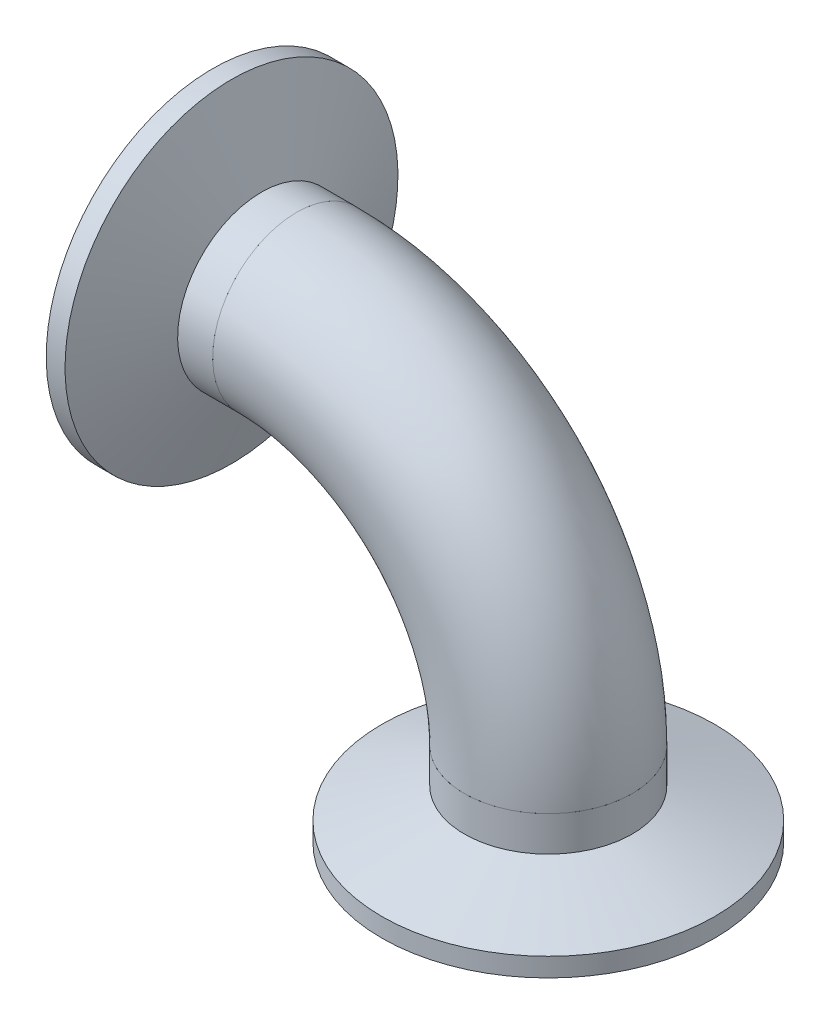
ISO-10303-21;
HEADER;
FILE_DESCRIPTION(('STEP AP214'),'2;1');
FILE_NAME('part.step','',(''),(''),'','','');
FILE_SCHEMA(('AUTOMOTIVE_DESIGN { 1 0 10303 214 1 1 1 1 }'));
ENDSEC;
DATA;
#1=APPLICATION_CONTEXT('core data for automotive mechanical design processes');
#2=APPLICATION_PROTOCOL_DEFINITION('international standard','automotive_design',2000,#1);
#3=PRODUCT_CONTEXT('',#1,'mechanical');
#4=PRODUCT('Part','Part','',(#3));
#5=PRODUCT_RELATED_PRODUCT_CATEGORY('part','',(#4));
#6=PRODUCT_DEFINITION_FORMATION('','',#4);
#7=PRODUCT_DEFINITION_CONTEXT('part definition',#1,'design');
#8=PRODUCT_DEFINITION('design','',#6,#7);
#9=PRODUCT_DEFINITION_SHAPE('','',#8);
#10=(LENGTH_UNIT() NAMED_UNIT(*) SI_UNIT(.MILLI.,.METRE.));
#11=(NAMED_UNIT(*) PLANE_ANGLE_UNIT() SI_UNIT($,.RADIAN.));
#12=(NAMED_UNIT(*) SI_UNIT($,.STERADIAN.) SOLID_ANGLE_UNIT());
#13=UNCERTAINTY_MEASURE_WITH_UNIT(LENGTH_MEASURE(1.E-05),#10,'distance_accuracy_value','');
#14=(GEOMETRIC_REPRESENTATION_CONTEXT(3) GLOBAL_UNCERTAINTY_ASSIGNED_CONTEXT((#13)) GLOBAL_UNIT_ASSIGNED_CONTEXT((#10,
#11,#12)) REPRESENTATION_CONTEXT('',''));
#15=CARTESIAN_POINT('',(0.,0.,0.));
#16=DIRECTION('',(0.,0.,1.));
#17=DIRECTION('',(1.,0.,0.));
#18=AXIS2_PLACEMENT_3D('',#15,#16,#17);
#19=CARTESIAN_POINT('',(6.05161411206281,16.6894268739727,52.4782290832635));
#20=DIRECTION('',(0.,0.,-1.));
#21=DIRECTION('',(-1.,0.,0.));
#22=AXIS2_PLACEMENT_3D('',#19,#20,#21);
#23=TOROIDAL_SURFACE('',#22,38.1,12.7);
#24=CARTESIAN_POINT('',(6.05161411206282,54.7894268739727,52.4782290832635));
#25=DIRECTION('',(-1.,0.,0.));
#26=DIRECTION('',(0.,0.,1.));
#27=AXIS2_PLACEMENT_3D('',#24,#25,#26);
#28=CIRCLE('',#27,12.7);
#29=CARTESIAN_POINT('',(6.05161411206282,67.4894268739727,52.4782290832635));
#30=VERTEX_POINT('',#29);
#31=EDGE_CURVE('P0_E10',#30,#30,#28,.T.);
#32=CARTESIAN_POINT('',(44.1516141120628,16.6894268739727,52.4782290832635));
#33=DIRECTION('',(0.,1.,0.));
#34=DIRECTION('',(0.,0.,1.));
#35=AXIS2_PLACEMENT_3D('',#32,#33,#34);
#36=CIRCLE('',#35,12.7);
#37=CARTESIAN_POINT('',(56.8516141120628,16.6894268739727,52.4782290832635));
#38=VERTEX_POINT('',#37);
#39=EDGE_CURVE('P0_E21',#38,#38,#36,.T.);
#40=CARTESIAN_POINT('',(6.05161411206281,16.6894268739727,52.4782290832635));
#41=DIRECTION('',(0.,0.,-1.));
#42=DIRECTION('',(-1.,0.,0.));
#43=AXIS2_PLACEMENT_3D('',#40,#41,#42);
#44=CIRCLE('',#43,50.8);
#45=EDGE_CURVE('',#30,#38,#44,.T.);
#46=ORIENTED_EDGE('',*,*,#31,.F.);
#47=ORIENTED_EDGE('',*,*,#39,.T.);
#48=ORIENTED_EDGE('',*,*,#45,.T.);
#49=ORIENTED_EDGE('',*,*,#45,.F.);
#50=EDGE_LOOP('',(#46,#48,#47,#49));
#51=FACE_BOUND('',#50,.T.);
#52=ADVANCED_FACE('P0_F15',(#51),#23,.T.);
#53=CARTESIAN_POINT('',(6.05161411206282,54.7894268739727,52.4782290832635));
#54=DIRECTION('',(-1.,0.,0.));
#55=DIRECTION('',(0.,0.,1.));
#56=AXIS2_PLACEMENT_3D('',#53,#54,#55);
#57=PLANE('',#56);
#58=CARTESIAN_POINT('',(6.05161411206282,54.7894268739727,52.4782290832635));
#59=DIRECTION('',(-1.,0.,0.));
#60=DIRECTION('',(0.,-1.,0.));
#61=AXIS2_PLACEMENT_3D('',#58,#59,#60);
#62=CIRCLE('',#61,11.049);
#63=CARTESIAN_POINT('',(6.05161411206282,65.8384268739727,52.4782290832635));
#64=VERTEX_POINT('',#63);
#65=EDGE_CURVE('P0_E25',#64,#64,#62,.T.);
#66=ORIENTED_EDGE('',*,*,#65,.F.);
#67=EDGE_LOOP('',(#66));
#68=FACE_BOUND('',#67,.T.);
#69=ORIENTED_EDGE('',*,*,#31,.T.);
#70=EDGE_LOOP('',(#69));
#71=FACE_BOUND('',#70,.T.);
#72=ADVANCED_FACE('P0_F46',(#68,#71),#57,.T.);
#73=CARTESIAN_POINT('',(44.1516141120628,16.6894268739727,52.4782290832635));
#74=DIRECTION('',(0.,1.,0.));
#75=DIRECTION('',(0.,0.,1.));
#76=AXIS2_PLACEMENT_3D('',#73,#74,#75);
#77=PLANE('',#76);
#78=CARTESIAN_POINT('',(44.1516141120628,16.6894268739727,52.4782290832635));
#79=DIRECTION('',(0.,1.,0.));
#80=DIRECTION('',(0.,0.,1.));
#81=AXIS2_PLACEMENT_3D('',#78,#79,#80);
#82=CIRCLE('',#81,11.049);
#83=CARTESIAN_POINT('',(55.2006141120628,16.6894268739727,52.4782290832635));
#84=VERTEX_POINT('',#83);
#85=EDGE_CURVE('P0_E29',#84,#84,#82,.T.);
#86=ORIENTED_EDGE('',*,*,#85,.T.);
#87=EDGE_LOOP('',(#86));
#88=FACE_BOUND('',#87,.T.);
#89=ORIENTED_EDGE('',*,*,#39,.F.);
#90=EDGE_LOOP('',(#89));
#91=FACE_BOUND('',#90,.T.);
#92=ADVANCED_FACE('P0_F35',(#88,#91),#77,.F.);
#93=CARTESIAN_POINT('',(6.05161411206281,16.6894268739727,52.4782290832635));
#94=DIRECTION('',(0.,0.,-1.));
#95=DIRECTION('',(-1.,0.,0.));
#96=AXIS2_PLACEMENT_3D('',#93,#94,#95);
#97=TOROIDAL_SURFACE('',#96,38.1,11.049);
#98=CARTESIAN_POINT('',(6.05161411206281,16.6894268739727,52.4782290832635));
#99=DIRECTION('',(0.,0.,-1.));
#100=DIRECTION('',(-1.,0.,0.));
#101=AXIS2_PLACEMENT_3D('',#98,#99,#100);
#102=CIRCLE('',#101,49.149);
#103=EDGE_CURVE('',#64,#84,#102,.T.);
#104=ORIENTED_EDGE('',*,*,#65,.T.);
#105=ORIENTED_EDGE('',*,*,#85,.F.);
#106=ORIENTED_EDGE('',*,*,#103,.T.);
#107=ORIENTED_EDGE('',*,*,#103,.F.);
#108=EDGE_LOOP('',(#104,#106,#105,#107));
#109=FACE_BOUND('',#108,.T.);
#110=ADVANCED_FACE('P0_F38',(#109),#97,.F.);
#111=CLOSED_SHELL('',(#52,#72,#92,#110));
#112=MANIFOLD_SOLID_BREP('P0_B1',#111);
#113=CARTESIAN_POINT('',(-5.86098588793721,54.7894268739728,52.4782290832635));
#114=DIRECTION('',(-1.,0.,0.));
#115=DIRECTION('',(0.,0.877848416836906,-0.478938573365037));
#116=AXIS2_PLACEMENT_3D('',#113,#114,#115);
#117=TOROIDAL_SURFACE('',#116,23.6366084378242,0.787399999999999);
#118=CARTESIAN_POINT('',(-6.64838588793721,54.7894268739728,52.4782290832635));
#119=DIRECTION('',(-1.,0.,0.));
#120=DIRECTION('',(0.,0.877848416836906,-0.478938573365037));
#121=AXIS2_PLACEMENT_3D('',#118,#119,#120);
#122=CIRCLE('',#121,23.6366084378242);
#123=CARTESIAN_POINT('',(-6.64838588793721,75.5387861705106,41.157745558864));
#124=VERTEX_POINT('',#123);
#125=EDGE_CURVE('P1_E48',#124,#124,#122,.T.);
#126=ORIENTED_EDGE('',*,*,#125,.T.);
#127=EDGE_LOOP('',(#126));
#128=FACE_BOUND('',#127,.T.);
#129=CARTESIAN_POINT('',(-6.17392691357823,54.7894268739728,52.4782290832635));
#130=DIRECTION('',(-1.,0.,0.));
#131=DIRECTION('',(0.,0.877848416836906,-0.478938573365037));
#132=AXIS2_PLACEMENT_3D('',#129,#130,#131);
#133=CIRCLE('',#132,22.9140666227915);
#134=CARTESIAN_POINT('',(-6.17392691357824,74.9045039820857,41.5037987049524));
#135=VERTEX_POINT('',#134);
#136=EDGE_CURVE('P1_E9',#135,#135,#133,.T.);
#137=ORIENTED_EDGE('',*,*,#136,.F.);
#138=EDGE_LOOP('',(#137));
#139=FACE_BOUND('',#138,.T.);
#140=ADVANCED_FACE('P1_F14',(#128,#139),#117,.T.);
#141=CARTESIAN_POINT('',(-6.64838588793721,54.7894268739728,52.4782290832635));
#142=DIRECTION('',(-1.,0.,0.));
#143=DIRECTION('',(0.,0.877848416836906,-0.478938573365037));
#144=AXIS2_PLACEMENT_3D('',#141,#142,#143);
#145=TOROIDAL_SURFACE('',#144,21.8186,1.1938);
#146=CARTESIAN_POINT('',(-6.17392691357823,54.7894268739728,52.4782290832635));
#147=DIRECTION('',(-1.,0.,0.));
#148=DIRECTION('',(0.,0.877848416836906,-0.478938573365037));
#149=AXIS2_PLACEMENT_3D('',#146,#147,#148);
#150=CIRCLE('',#149,20.7231333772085);
#151=CARTESIAN_POINT('',(-6.17392691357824,72.9811967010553,42.5531211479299));
#152=VERTEX_POINT('',#151);
#153=EDGE_CURVE('P1_E20',#152,#152,#150,.T.);
#154=ORIENTED_EDGE('',*,*,#153,.F.);
#155=EDGE_LOOP('',(#154));
#156=FACE_BOUND('',#155,.T.);
#157=ORIENTED_EDGE('',*,*,#136,.T.);
#158=EDGE_LOOP('',(#157));
#159=FACE_BOUND('',#158,.T.);
#160=ADVANCED_FACE('P1_F97',(#156,#159),#145,.F.);
#161=CARTESIAN_POINT('',(-5.86098588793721,54.7894268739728,52.4782290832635));
#162=DIRECTION('',(-1.,0.,0.));
#163=DIRECTION('',(0.,0.877848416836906,-0.478938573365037));
#164=AXIS2_PLACEMENT_3D('',#161,#162,#163);
#165=TOROIDAL_SURFACE('',#164,20.0005915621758,0.787399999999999);
#166=ORIENTED_EDGE('',*,*,#153,.T.);
#167=EDGE_LOOP('',(#166));
#168=FACE_BOUND('',#167,.T.);
#169=CARTESIAN_POINT('',(-6.64838588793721,54.7894268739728,52.4782290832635));
#170=DIRECTION('',(-1.,0.,0.));
#171=DIRECTION('',(0.,0.877848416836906,-0.478938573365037));
#172=AXIS2_PLACEMENT_3D('',#169,#170,#171);
#173=CIRCLE('',#172,20.0005915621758);
#174=CARTESIAN_POINT('',(-6.64838588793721,72.3469145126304,42.8991742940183));
#175=VERTEX_POINT('',#174);
#176=EDGE_CURVE('P1_E24',#175,#175,#173,.T.);
#177=ORIENTED_EDGE('',*,*,#176,.F.);
#178=EDGE_LOOP('',(#177));
#179=FACE_BOUND('',#178,.T.);
#180=ADVANCED_FACE('P1_F93',(#168,#179),#165,.T.);
#181=CARTESIAN_POINT('',(-6.64838588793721,54.7894268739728,52.4782290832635));
#182=DIRECTION('',(1.,0.,0.));
#183=DIRECTION('',(0.,-0.877848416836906,0.478938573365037));
#184=AXIS2_PLACEMENT_3D('',#181,#182,#183);
#185=PLANE('',#184);
#186=CARTESIAN_POINT('',(-6.64838588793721,54.7894268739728,52.4782290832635));
#187=DIRECTION('',(-1.,0.,0.));
#188=DIRECTION('',(0.,0.877848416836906,-0.478938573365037));
#189=AXIS2_PLACEMENT_3D('',#186,#187,#188);
#190=CIRCLE('',#189,11.049);
#191=CARTESIAN_POINT('',(-6.64838588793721,64.4887740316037,47.1864367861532));
#192=VERTEX_POINT('',#191);
#193=EDGE_CURVE('P1_E28',#192,#192,#190,.T.);
#194=ORIENTED_EDGE('',*,*,#193,.F.);
#195=EDGE_LOOP('',(#194));
#196=FACE_BOUND('',#195,.T.);
#197=ORIENTED_EDGE('',*,*,#176,.T.);
#198=EDGE_LOOP('',(#197));
#199=FACE_BOUND('',#198,.T.);
#200=ADVANCED_FACE('P1_F86',(#196,#199),#185,.F.);
#201=CARTESIAN_POINT('',(-6.64838588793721,54.7894268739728,52.4782290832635));
#202=DIRECTION('',(-1.,0.,0.));
#203=DIRECTION('',(0.,0.877848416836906,-0.478938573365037));
#204=AXIS2_PLACEMENT_3D('',#201,#202,#203);
#205=CYLINDRICAL_SURFACE('',#204,11.049);
#206=ORIENTED_EDGE('',*,*,#193,.T.);
#207=EDGE_LOOP('',(#206));
#208=FACE_BOUND('',#207,.T.);
#209=CARTESIAN_POINT('',(6.05161411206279,54.7894268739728,52.4782290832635));
#210=DIRECTION('',(-1.,0.,0.));
#211=DIRECTION('',(0.,0.877848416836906,-0.478938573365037));
#212=AXIS2_PLACEMENT_3D('',#209,#210,#211);
#213=CIRCLE('',#212,11.049);
#214=CARTESIAN_POINT('',(6.05161411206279,64.4887740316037,47.1864367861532));
#215=VERTEX_POINT('',#214);
#216=EDGE_CURVE('P1_E33',#215,#215,#213,.T.);
#217=ORIENTED_EDGE('',*,*,#216,.F.);
#218=EDGE_LOOP('',(#217));
#219=FACE_BOUND('',#218,.T.);
#220=ADVANCED_FACE('P1_F81',(#208,#219),#205,.F.);
#221=CARTESIAN_POINT('',(6.05161411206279,54.7894268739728,52.4782290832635));
#222=DIRECTION('',(-1.,0.,0.));
#223=DIRECTION('',(0.,0.877848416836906,-0.478938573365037));
#224=AXIS2_PLACEMENT_3D('',#221,#222,#223);
#225=PLANE('',#224);
#226=CARTESIAN_POINT('',(6.05161411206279,54.7894268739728,52.4782290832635));
#227=DIRECTION('',(-1.,0.,0.));
#228=DIRECTION('',(0.,0.877848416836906,-0.478938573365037));
#229=AXIS2_PLACEMENT_3D('',#226,#227,#228);
#230=CIRCLE('',#229,12.7);
#231=CARTESIAN_POINT('',(6.05161411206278,65.9381017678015,46.3957092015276));
#232=VERTEX_POINT('',#231);
#233=EDGE_CURVE('P1_E36',#232,#232,#230,.T.);
#234=ORIENTED_EDGE('',*,*,#233,.F.);
#235=EDGE_LOOP('',(#234));
#236=FACE_BOUND('',#235,.T.);
#237=ORIENTED_EDGE('',*,*,#216,.T.);
#238=EDGE_LOOP('',(#237));
#239=FACE_BOUND('',#238,.T.);
#240=ADVANCED_FACE('P1_F75',(#236,#239),#225,.F.);
#241=CARTESIAN_POINT('',(-6.64838588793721,54.7894268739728,52.4782290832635));
#242=DIRECTION('',(-1.,0.,0.));
#243=DIRECTION('',(0.,0.877848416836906,-0.478938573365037));
#244=AXIS2_PLACEMENT_3D('',#241,#242,#243);
#245=CYLINDRICAL_SURFACE('',#244,12.7);
#246=CARTESIAN_POINT('',(0.744877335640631,54.7894268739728,52.4782290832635));
#247=DIRECTION('',(-1.,0.,0.));
#248=DIRECTION('',(0.,0.877848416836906,-0.478938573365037));
#249=AXIS2_PLACEMENT_3D('',#246,#247,#248);
#250=CIRCLE('',#249,12.7);
#251=CARTESIAN_POINT('',(0.744877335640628,65.9381017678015,46.3957092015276));
#252=VERTEX_POINT('',#251);
#253=EDGE_CURVE('P1_E39',#252,#252,#250,.T.);
#254=ORIENTED_EDGE('',*,*,#253,.F.);
#255=EDGE_LOOP('',(#254));
#256=FACE_BOUND('',#255,.T.);
#257=ORIENTED_EDGE('',*,*,#233,.T.);
#258=EDGE_LOOP('',(#257));
#259=FACE_BOUND('',#258,.T.);
#260=ADVANCED_FACE('P1_F69',(#256,#259),#245,.T.);
#261=CARTESIAN_POINT('',(0.744877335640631,54.7894268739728,52.4782290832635));
#262=DIRECTION('',(-1.,0.,0.));
#263=DIRECTION('',(0.,0.877848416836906,-0.478938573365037));
#264=AXIS2_PLACEMENT_3D('',#261,#262,#263);
#265=CONICAL_SURFACE('',#264,12.7,1.22173047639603);
#266=CARTESIAN_POINT('',(-3.80358588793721,54.7894268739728,52.4782290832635));
#267=DIRECTION('',(-1.,0.,0.));
#268=DIRECTION('',(0.,0.877848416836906,-0.478938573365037));
#269=AXIS2_PLACEMENT_3D('',#266,#267,#268);
#270=CIRCLE('',#269,25.1968);
#271=CARTESIAN_POINT('',(-3.80358588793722,76.9083978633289,40.4105096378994));
#272=VERTEX_POINT('',#271);
#273=EDGE_CURVE('P1_E42',#272,#272,#270,.T.);
#274=ORIENTED_EDGE('',*,*,#273,.F.);
#275=EDGE_LOOP('',(#274));
#276=FACE_BOUND('',#275,.T.);
#277=ORIENTED_EDGE('',*,*,#253,.T.);
#278=EDGE_LOOP('',(#277));
#279=FACE_BOUND('',#278,.T.);
#280=ADVANCED_FACE('P1_F63',(#276,#279),#265,.T.);
#281=CARTESIAN_POINT('',(-6.64838588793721,54.7894268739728,52.4782290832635));
#282=DIRECTION('',(-1.,0.,0.));
#283=DIRECTION('',(0.,0.877848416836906,-0.478938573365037));
#284=AXIS2_PLACEMENT_3D('',#281,#282,#283);
#285=CYLINDRICAL_SURFACE('',#284,25.1968);
#286=CARTESIAN_POINT('',(-6.64838588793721,54.7894268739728,52.4782290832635));
#287=DIRECTION('',(-1.,0.,0.));
#288=DIRECTION('',(0.,0.877848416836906,-0.478938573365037));
#289=AXIS2_PLACEMENT_3D('',#286,#287,#288);
#290=CIRCLE('',#289,25.1968);
#291=CARTESIAN_POINT('',(-6.64838588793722,76.9083978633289,40.4105096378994));
#292=VERTEX_POINT('',#291);
#293=EDGE_CURVE('P1_E45',#292,#292,#290,.T.);
#294=ORIENTED_EDGE('',*,*,#293,.F.);
#295=EDGE_LOOP('',(#294));
#296=FACE_BOUND('',#295,.T.);
#297=ORIENTED_EDGE('',*,*,#273,.T.);
#298=EDGE_LOOP('',(#297));
#299=FACE_BOUND('',#298,.T.);
#300=ADVANCED_FACE('P1_F57',(#296,#299),#285,.T.);
#301=CARTESIAN_POINT('',(-6.64838588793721,54.7894268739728,52.4782290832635));
#302=DIRECTION('',(1.,0.,0.));
#303=DIRECTION('',(0.,-0.877848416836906,0.478938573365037));
#304=AXIS2_PLACEMENT_3D('',#301,#302,#303);
#305=PLANE('',#304);
#306=ORIENTED_EDGE('',*,*,#125,.F.);
#307=EDGE_LOOP('',(#306));
#308=FACE_BOUND('',#307,.T.);
#309=ORIENTED_EDGE('',*,*,#293,.T.);
#310=EDGE_LOOP('',(#309));
#311=FACE_BOUND('',#310,.T.);
#312=ADVANCED_FACE('P1_F54',(#308,#311),#305,.F.);
#313=CLOSED_SHELL('',(#140,#160,#180,#200,#220,#240,#260,#280,#300,#312));
#314=MANIFOLD_SOLID_BREP('P1_B1',#313);
#315=CARTESIAN_POINT('',(44.1516141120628,4.7768268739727,52.4782290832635));
#316=DIRECTION('',(0.,-1.,0.));
#317=DIRECTION('',(0.,0.,-1.));
#318=AXIS2_PLACEMENT_3D('',#315,#316,#317);
#319=TOROIDAL_SURFACE('',#318,23.6366084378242,0.787399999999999);
#320=CARTESIAN_POINT('',(44.1516141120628,3.9894268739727,52.4782290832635));
#321=DIRECTION('',(0.,-1.,0.));
#322=DIRECTION('',(0.,0.,-1.));
#323=AXIS2_PLACEMENT_3D('',#320,#321,#322);
#324=CIRCLE('',#323,23.6366084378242);
#325=CARTESIAN_POINT('',(44.1516141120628,3.9894268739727,28.8416206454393));
#326=VERTEX_POINT('',#325);
#327=EDGE_CURVE('P2_E49',#326,#326,#324,.T.);
#328=ORIENTED_EDGE('',*,*,#327,.T.);
#329=EDGE_LOOP('',(#328));
#330=FACE_BOUND('',#329,.T.);
#331=CARTESIAN_POINT('',(44.1516141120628,4.46388584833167,52.4782290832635));
#332=DIRECTION('',(0.,-1.,0.));
#333=DIRECTION('',(0.,0.,-1.));
#334=AXIS2_PLACEMENT_3D('',#331,#332,#333);
#335=CIRCLE('',#334,22.9140666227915);
#336=CARTESIAN_POINT('',(44.1516141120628,4.46388584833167,29.564162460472));
#337=VERTEX_POINT('',#336);
#338=EDGE_CURVE('P2_E10',#337,#337,#335,.T.);
#339=ORIENTED_EDGE('',*,*,#338,.F.);
#340=EDGE_LOOP('',(#339));
#341=FACE_BOUND('',#340,.T.);
#342=ADVANCED_FACE('P2_F15',(#330,#341),#319,.T.);
#343=CARTESIAN_POINT('',(44.1516141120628,3.9894268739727,52.4782290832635));
#344=DIRECTION('',(0.,-1.,0.));
#345=DIRECTION('',(0.,0.,-1.));
#346=AXIS2_PLACEMENT_3D('',#343,#344,#345);
#347=TOROIDAL_SURFACE('',#346,21.8186,1.1938);
#348=CARTESIAN_POINT('',(44.1516141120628,4.46388584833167,52.4782290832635));
#349=DIRECTION('',(0.,-1.,0.));
#350=DIRECTION('',(0.,0.,-1.));
#351=AXIS2_PLACEMENT_3D('',#348,#349,#350);
#352=CIRCLE('',#351,20.7231333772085);
#353=CARTESIAN_POINT('',(44.1516141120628,4.46388584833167,31.755095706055));
#354=VERTEX_POINT('',#353);
#355=EDGE_CURVE('P2_E21',#354,#354,#352,.T.);
#356=ORIENTED_EDGE('',*,*,#355,.F.);
#357=EDGE_LOOP('',(#356));
#358=FACE_BOUND('',#357,.T.);
#359=ORIENTED_EDGE('',*,*,#338,.T.);
#360=EDGE_LOOP('',(#359));
#361=FACE_BOUND('',#360,.T.);
#362=ADVANCED_FACE('P2_F98',(#358,#361),#347,.F.);
#363=CARTESIAN_POINT('',(44.1516141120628,4.7768268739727,52.4782290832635));
#364=DIRECTION('',(0.,-1.,0.));
#365=DIRECTION('',(0.,0.,-1.));
#366=AXIS2_PLACEMENT_3D('',#363,#364,#365);
#367=TOROIDAL_SURFACE('',#366,20.0005915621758,0.787399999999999);
#368=ORIENTED_EDGE('',*,*,#355,.T.);
#369=EDGE_LOOP('',(#368));
#370=FACE_BOUND('',#369,.T.);
#371=CARTESIAN_POINT('',(44.1516141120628,3.9894268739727,52.4782290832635));
#372=DIRECTION('',(0.,-1.,0.));
#373=DIRECTION('',(0.,0.,-1.));
#374=AXIS2_PLACEMENT_3D('',#371,#372,#373);
#375=CIRCLE('',#374,20.0005915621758);
#376=CARTESIAN_POINT('',(44.1516141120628,3.9894268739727,32.4776375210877));
#377=VERTEX_POINT('',#376);
#378=EDGE_CURVE('P2_E25',#377,#377,#375,.T.);
#379=ORIENTED_EDGE('',*,*,#378,.F.);
#380=EDGE_LOOP('',(#379));
#381=FACE_BOUND('',#380,.T.);
#382=ADVANCED_FACE('P2_F94',(#370,#381),#367,.T.);
#383=CARTESIAN_POINT('',(44.1516141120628,3.9894268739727,52.4782290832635));
#384=DIRECTION('',(0.,1.,0.));
#385=DIRECTION('',(0.,0.,1.));
#386=AXIS2_PLACEMENT_3D('',#383,#384,#385);
#387=PLANE('',#386);
#388=CARTESIAN_POINT('',(44.1516141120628,3.9894268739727,52.4782290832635));
#389=DIRECTION('',(0.,-1.,0.));
#390=DIRECTION('',(0.,0.,-1.));
#391=AXIS2_PLACEMENT_3D('',#388,#389,#390);
#392=CIRCLE('',#391,11.049);
#393=CARTESIAN_POINT('',(44.1516141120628,3.9894268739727,41.4292290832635));
#394=VERTEX_POINT('',#393);
#395=EDGE_CURVE('P2_E29',#394,#394,#392,.T.);
#396=ORIENTED_EDGE('',*,*,#395,.F.);
#397=EDGE_LOOP('',(#396));
#398=FACE_BOUND('',#397,.T.);
#399=ORIENTED_EDGE('',*,*,#378,.T.);
#400=EDGE_LOOP('',(#399));
#401=FACE_BOUND('',#400,.T.);
#402=ADVANCED_FACE('P2_F87',(#398,#401),#387,.F.);
#403=CARTESIAN_POINT('',(44.1516141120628,3.9894268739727,52.4782290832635));
#404=DIRECTION('',(0.,-1.,0.));
#405=DIRECTION('',(0.,0.,-1.));
#406=AXIS2_PLACEMENT_3D('',#403,#404,#405);
#407=CYLINDRICAL_SURFACE('',#406,11.049);
#408=ORIENTED_EDGE('',*,*,#395,.T.);
#409=EDGE_LOOP('',(#408));
#410=FACE_BOUND('',#409,.T.);
#411=CARTESIAN_POINT('',(44.1516141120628,16.6894268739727,52.4782290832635));
#412=DIRECTION('',(0.,-1.,0.));
#413=DIRECTION('',(0.,0.,-1.));
#414=AXIS2_PLACEMENT_3D('',#411,#412,#413);
#415=CIRCLE('',#414,11.049);
#416=CARTESIAN_POINT('',(44.1516141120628,16.6894268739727,41.4292290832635));
#417=VERTEX_POINT('',#416);
#418=EDGE_CURVE('P2_E34',#417,#417,#415,.T.);
#419=ORIENTED_EDGE('',*,*,#418,.F.);
#420=EDGE_LOOP('',(#419));
#421=FACE_BOUND('',#420,.T.);
#422=ADVANCED_FACE('P2_F82',(#410,#421),#407,.F.);
#423=CARTESIAN_POINT('',(44.1516141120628,16.6894268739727,52.4782290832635));
#424=DIRECTION('',(0.,-1.,0.));
#425=DIRECTION('',(0.,0.,-1.));
#426=AXIS2_PLACEMENT_3D('',#423,#424,#425);
#427=PLANE('',#426);
#428=CARTESIAN_POINT('',(44.1516141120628,16.6894268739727,52.4782290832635));
#429=DIRECTION('',(0.,-1.,0.));
#430=DIRECTION('',(0.,0.,-1.));
#431=AXIS2_PLACEMENT_3D('',#428,#429,#430);
#432=CIRCLE('',#431,12.7);
#433=CARTESIAN_POINT('',(44.1516141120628,16.6894268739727,39.7782290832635));
#434=VERTEX_POINT('',#433);
#435=EDGE_CURVE('P2_E37',#434,#434,#432,.T.);
#436=ORIENTED_EDGE('',*,*,#435,.F.);
#437=EDGE_LOOP('',(#436));
#438=FACE_BOUND('',#437,.T.);
#439=ORIENTED_EDGE('',*,*,#418,.T.);
#440=EDGE_LOOP('',(#439));
#441=FACE_BOUND('',#440,.T.);
#442=ADVANCED_FACE('P2_F76',(#438,#441),#427,.F.);
#443=CARTESIAN_POINT('',(44.1516141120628,3.9894268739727,52.4782290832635));
#444=DIRECTION('',(0.,-1.,0.));
#445=DIRECTION('',(0.,0.,-1.));
#446=AXIS2_PLACEMENT_3D('',#443,#444,#445);
#447=CYLINDRICAL_SURFACE('',#446,12.7);
#448=CARTESIAN_POINT('',(44.1516141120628,11.3826900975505,52.4782290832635));
#449=DIRECTION('',(0.,-1.,0.));
#450=DIRECTION('',(0.,0.,-1.));
#451=AXIS2_PLACEMENT_3D('',#448,#449,#450);
#452=CIRCLE('',#451,12.7);
#453=CARTESIAN_POINT('',(44.1516141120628,11.3826900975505,39.7782290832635));
#454=VERTEX_POINT('',#453);
#455=EDGE_CURVE('P2_E40',#454,#454,#452,.T.);
#456=ORIENTED_EDGE('',*,*,#455,.F.);
#457=EDGE_LOOP('',(#456));
#458=FACE_BOUND('',#457,.T.);
#459=ORIENTED_EDGE('',*,*,#435,.T.);
#460=EDGE_LOOP('',(#459));
#461=FACE_BOUND('',#460,.T.);
#462=ADVANCED_FACE('P2_F70',(#458,#461),#447,.T.);
#463=CARTESIAN_POINT('',(44.1516141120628,11.3826900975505,52.4782290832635));
#464=DIRECTION('',(0.,-1.,0.));
#465=DIRECTION('',(0.,0.,-1.));
#466=AXIS2_PLACEMENT_3D('',#463,#464,#465);
#467=CONICAL_SURFACE('',#466,12.7,1.22173047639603);
#468=CARTESIAN_POINT('',(44.1516141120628,6.8342268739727,52.4782290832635));
#469=DIRECTION('',(0.,-1.,0.));
#470=DIRECTION('',(0.,0.,-1.));
#471=AXIS2_PLACEMENT_3D('',#468,#469,#470);
#472=CIRCLE('',#471,25.1968);
#473=CARTESIAN_POINT('',(44.1516141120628,6.8342268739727,27.2814290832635));
#474=VERTEX_POINT('',#473);
#475=EDGE_CURVE('P2_E43',#474,#474,#472,.T.);
#476=ORIENTED_EDGE('',*,*,#475,.F.);
#477=EDGE_LOOP('',(#476));
#478=FACE_BOUND('',#477,.T.);
#479=ORIENTED_EDGE('',*,*,#455,.T.);
#480=EDGE_LOOP('',(#479));
#481=FACE_BOUND('',#480,.T.);
#482=ADVANCED_FACE('P2_F64',(#478,#481),#467,.T.);
#483=CARTESIAN_POINT('',(44.1516141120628,3.9894268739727,52.4782290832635));
#484=DIRECTION('',(0.,-1.,0.));
#485=DIRECTION('',(0.,0.,-1.));
#486=AXIS2_PLACEMENT_3D('',#483,#484,#485);
#487=CYLINDRICAL_SURFACE('',#486,25.1968);
#488=CARTESIAN_POINT('',(44.1516141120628,3.9894268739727,52.4782290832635));
#489=DIRECTION('',(0.,-1.,0.));
#490=DIRECTION('',(0.,0.,-1.));
#491=AXIS2_PLACEMENT_3D('',#488,#489,#490);
#492=CIRCLE('',#491,25.1968);
#493=CARTESIAN_POINT('',(44.1516141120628,3.9894268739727,27.2814290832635));
#494=VERTEX_POINT('',#493);
#495=EDGE_CURVE('P2_E46',#494,#494,#492,.T.);
#496=ORIENTED_EDGE('',*,*,#495,.F.);
#497=EDGE_LOOP('',(#496));
#498=FACE_BOUND('',#497,.T.);
#499=ORIENTED_EDGE('',*,*,#475,.T.);
#500=EDGE_LOOP('',(#499));
#501=FACE_BOUND('',#500,.T.);
#502=ADVANCED_FACE('P2_F58',(#498,#501),#487,.T.);
#503=CARTESIAN_POINT('',(44.1516141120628,3.9894268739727,52.4782290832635));
#504=DIRECTION('',(0.,1.,0.));
#505=DIRECTION('',(0.,0.,1.));
#506=AXIS2_PLACEMENT_3D('',#503,#504,#505);
#507=PLANE('',#506);
#508=ORIENTED_EDGE('',*,*,#327,.F.);
#509=EDGE_LOOP('',(#508));
#510=FACE_BOUND('',#509,.T.);
#511=ORIENTED_EDGE('',*,*,#495,.T.);
#512=EDGE_LOOP('',(#511));
#513=FACE_BOUND('',#512,.T.);
#514=ADVANCED_FACE('P2_F55',(#510,#513),#507,.F.);
#515=CLOSED_SHELL('',(#342,#362,#382,#402,#422,#442,#462,#482,#502,#514));
#516=MANIFOLD_SOLID_BREP('P2_B1',#515);
#517=ADVANCED_BREP_SHAPE_REPRESENTATION('',(#18,#112,#314,#516),#14);
#518=SHAPE_DEFINITION_REPRESENTATION(#9,#517);
ENDSEC;
END-ISO-10303-21;
